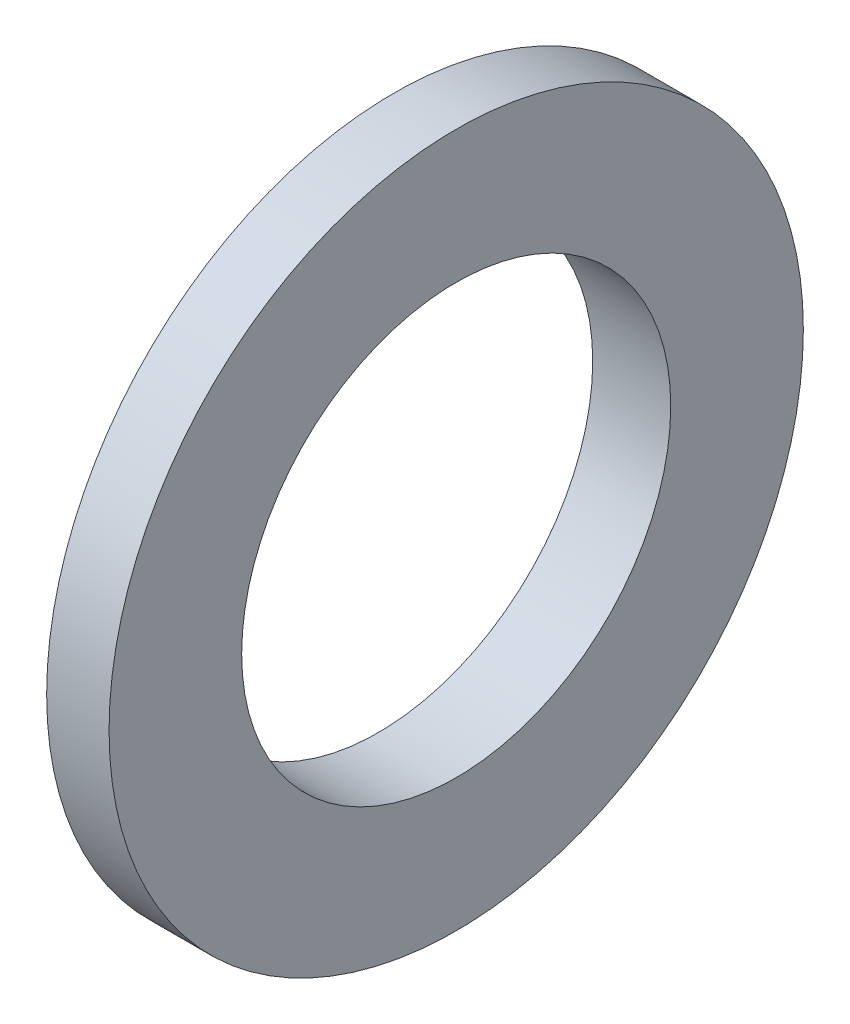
from build123d import *


with BuildPart() as part:
    # Esquisse1 → R_volution1 (revolve)
    with BuildSketch(Plane.XY, mode=Mode.PRIVATE) as r_volution1_sk:
        Polygon((0, 27.5), (0, 32.5), (2, 32.5), (2, 44.5), (10, 44.5), (10, 27.5), align=None)
    revolve(r_volution1_sk.sketch.rotate(Axis((-28.412220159, 0, 0), (1, 0, 0)), 90), axis=Axis((-28.412220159, 0, 0), (1, 0, 0)))


solid = part.part
